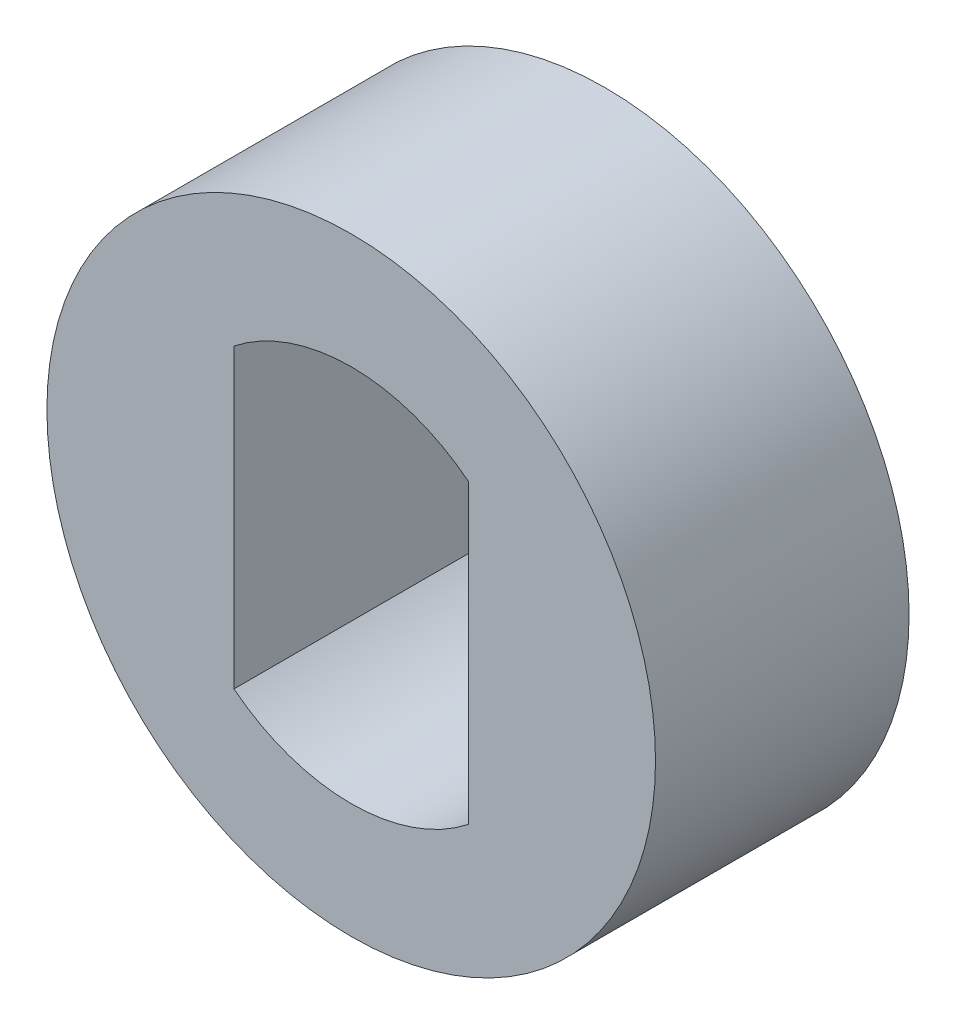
ISO-10303-21;
HEADER;
FILE_DESCRIPTION(('STEP AP214'),'2;1');
FILE_NAME('part.step','',(''),(''),'','','');
FILE_SCHEMA(('AUTOMOTIVE_DESIGN { 1 0 10303 214 1 1 1 1 }'));
ENDSEC;
DATA;
#1=APPLICATION_CONTEXT('core data for automotive mechanical design processes');
#2=APPLICATION_PROTOCOL_DEFINITION('international standard','automotive_design',2000,#1);
#3=PRODUCT_CONTEXT('',#1,'mechanical');
#4=PRODUCT('Part','Part','',(#3));
#5=PRODUCT_RELATED_PRODUCT_CATEGORY('part','',(#4));
#6=PRODUCT_DEFINITION_FORMATION('','',#4);
#7=PRODUCT_DEFINITION_CONTEXT('part definition',#1,'design');
#8=PRODUCT_DEFINITION('design','',#6,#7);
#9=PRODUCT_DEFINITION_SHAPE('','',#8);
#10=(LENGTH_UNIT() NAMED_UNIT(*) SI_UNIT(.MILLI.,.METRE.));
#11=(NAMED_UNIT(*) PLANE_ANGLE_UNIT() SI_UNIT($,.RADIAN.));
#12=(NAMED_UNIT(*) SI_UNIT($,.STERADIAN.) SOLID_ANGLE_UNIT());
#13=UNCERTAINTY_MEASURE_WITH_UNIT(LENGTH_MEASURE(1.E-05),#10,'distance_accuracy_value','');
#14=(GEOMETRIC_REPRESENTATION_CONTEXT(3) GLOBAL_UNCERTAINTY_ASSIGNED_CONTEXT((#13)) GLOBAL_UNIT_ASSIGNED_CONTEXT((#10,
#11,#12)) REPRESENTATION_CONTEXT('',''));
#15=CARTESIAN_POINT('',(0.,0.,0.));
#16=DIRECTION('',(0.,0.,1.));
#17=DIRECTION('',(1.,0.,0.));
#18=AXIS2_PLACEMENT_3D('',#15,#16,#17);
#19=CARTESIAN_POINT('',(0.,0.,4.));
#20=DIRECTION('',(0.,0.,1.));
#21=DIRECTION('',(1.,0.,0.));
#22=AXIS2_PLACEMENT_3D('',#19,#20,#21);
#23=PLANE('',#22);
#24=CARTESIAN_POINT('',(0.,0.,4.));
#25=DIRECTION('',(0.,0.,1.));
#26=DIRECTION('',(1.,0.,0.));
#27=AXIS2_PLACEMENT_3D('',#24,#25,#26);
#28=CIRCLE('',#27,4.8);
#29=CARTESIAN_POINT('',(4.8,0.,4.));
#30=VERTEX_POINT('',#29);
#31=EDGE_CURVE('E11',#30,#30,#28,.T.);
#32=ORIENTED_EDGE('',*,*,#31,.T.);
#33=EDGE_LOOP('',(#32));
#34=FACE_BOUND('',#33,.T.);
#35=DIRECTION('',(0.,-1.,0.));
#36=VECTOR('',#35,1.);
#37=CARTESIAN_POINT('',(-1.85,2.34210949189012,4.));
#38=LINE('',#37,#36);
#39=CARTESIAN_POINT('',(-1.85,2.34210949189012,4.));
#40=VERTEX_POINT('',#39);
#41=CARTESIAN_POINT('',(-1.85,-2.34210949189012,4.));
#42=VERTEX_POINT('',#41);
#43=EDGE_CURVE('E81',#40,#42,#38,.T.);
#44=ORIENTED_EDGE('',*,*,#43,.F.);
#45=CARTESIAN_POINT('',(0.,0.,4.));
#46=DIRECTION('',(0.,0.,1.));
#47=DIRECTION('',(1.,0.,0.));
#48=AXIS2_PLACEMENT_3D('',#45,#46,#47);
#49=CIRCLE('',#48,2.98462340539);
#50=CARTESIAN_POINT('',(1.85,2.34210949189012,4.));
#51=VERTEX_POINT('',#50);
#52=EDGE_CURVE('E73',#51,#40,#49,.T.);
#53=ORIENTED_EDGE('',*,*,#52,.F.);
#54=DIRECTION('',(0.,1.,0.));
#55=VECTOR('',#54,1.);
#56=CARTESIAN_POINT('',(1.85,2.34210949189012,4.));
#57=LINE('',#56,#55);
#58=CARTESIAN_POINT('',(1.85,-2.34210949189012,4.));
#59=VERTEX_POINT('',#58);
#60=EDGE_CURVE('E94',#59,#51,#57,.T.);
#61=ORIENTED_EDGE('',*,*,#60,.F.);
#62=CARTESIAN_POINT('',(0.,0.,4.));
#63=DIRECTION('',(0.,0.,1.));
#64=DIRECTION('',(1.,0.,0.));
#65=AXIS2_PLACEMENT_3D('',#62,#63,#64);
#66=CIRCLE('',#65,2.98462340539);
#67=EDGE_CURVE('E92',#42,#59,#66,.T.);
#68=ORIENTED_EDGE('',*,*,#67,.F.);
#69=EDGE_LOOP('',(#44,#53,#61,#68));
#70=FACE_BOUND('',#69,.T.);
#71=ADVANCED_FACE('F32',(#34,#70),#23,.T.);
#72=CARTESIAN_POINT('',(0.,0.,0.));
#73=DIRECTION('',(0.,0.,1.));
#74=DIRECTION('',(1.,0.,0.));
#75=AXIS2_PLACEMENT_3D('',#72,#73,#74);
#76=PLANE('',#75);
#77=CARTESIAN_POINT('',(0.,0.,0.));
#78=DIRECTION('',(0.,0.,1.));
#79=DIRECTION('',(1.,0.,0.));
#80=AXIS2_PLACEMENT_3D('',#77,#78,#79);
#81=CIRCLE('',#80,4.8);
#82=CARTESIAN_POINT('',(4.8,0.,0.));
#83=VERTEX_POINT('',#82);
#84=EDGE_CURVE('E36',#83,#83,#81,.T.);
#85=ORIENTED_EDGE('',*,*,#84,.F.);
#86=EDGE_LOOP('',(#85));
#87=FACE_BOUND('',#86,.T.);
#88=CARTESIAN_POINT('',(0.,0.,0.));
#89=DIRECTION('',(0.,0.,1.));
#90=DIRECTION('',(1.,0.,0.));
#91=AXIS2_PLACEMENT_3D('',#88,#89,#90);
#92=CIRCLE('',#91,2.98462340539);
#93=CARTESIAN_POINT('',(1.85,2.34210949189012,0.));
#94=VERTEX_POINT('',#93);
#95=CARTESIAN_POINT('',(-1.85,2.34210949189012,0.));
#96=VERTEX_POINT('',#95);
#97=EDGE_CURVE('E55',#94,#96,#92,.T.);
#98=ORIENTED_EDGE('',*,*,#97,.T.);
#99=DIRECTION('',(0.,-1.,0.));
#100=VECTOR('',#99,1.);
#101=CARTESIAN_POINT('',(-1.85,2.34210949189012,0.));
#102=LINE('',#101,#100);
#103=CARTESIAN_POINT('',(-1.85,-2.34210949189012,0.));
#104=VERTEX_POINT('',#103);
#105=EDGE_CURVE('E88',#96,#104,#102,.T.);
#106=ORIENTED_EDGE('',*,*,#105,.T.);
#107=CARTESIAN_POINT('',(0.,0.,0.));
#108=DIRECTION('',(0.,0.,1.));
#109=DIRECTION('',(1.,0.,0.));
#110=AXIS2_PLACEMENT_3D('',#107,#108,#109);
#111=CIRCLE('',#110,2.98462340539);
#112=CARTESIAN_POINT('',(1.85,-2.34210949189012,0.));
#113=VERTEX_POINT('',#112);
#114=EDGE_CURVE('E100',#104,#113,#111,.T.);
#115=ORIENTED_EDGE('',*,*,#114,.T.);
#116=DIRECTION('',(0.,1.,0.));
#117=VECTOR('',#116,1.);
#118=CARTESIAN_POINT('',(1.85,2.34210949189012,0.));
#119=LINE('',#118,#117);
#120=EDGE_CURVE('E82',#113,#94,#119,.T.);
#121=ORIENTED_EDGE('',*,*,#120,.T.);
#122=EDGE_LOOP('',(#98,#106,#115,#121));
#123=FACE_BOUND('',#122,.T.);
#124=ADVANCED_FACE('F111',(#87,#123),#76,.F.);
#125=CARTESIAN_POINT('',(0.,0.,4.));
#126=DIRECTION('',(0.,0.,-1.));
#127=DIRECTION('',(-1.,0.,0.));
#128=AXIS2_PLACEMENT_3D('',#125,#126,#127);
#129=CYLINDRICAL_SURFACE('',#128,4.8);
#130=ORIENTED_EDGE('',*,*,#31,.F.);
#131=EDGE_LOOP('',(#130));
#132=FACE_BOUND('',#131,.T.);
#133=ORIENTED_EDGE('',*,*,#84,.T.);
#134=EDGE_LOOP('',(#133));
#135=FACE_BOUND('',#134,.T.);
#136=ADVANCED_FACE('F34',(#132,#135),#129,.T.);
#137=CARTESIAN_POINT('',(0.,0.,4.));
#138=DIRECTION('',(0.,0.,-1.));
#139=DIRECTION('',(-1.,0.,0.));
#140=AXIS2_PLACEMENT_3D('',#137,#138,#139);
#141=CYLINDRICAL_SURFACE('',#140,2.98462340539);
#142=ORIENTED_EDGE('',*,*,#97,.F.);
#143=DIRECTION('',(0.,0.,-1.));
#144=VECTOR('',#143,1.);
#145=CARTESIAN_POINT('',(1.85,2.34210949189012,4.));
#146=LINE('',#145,#144);
#147=EDGE_CURVE('E77',#51,#94,#146,.T.);
#148=ORIENTED_EDGE('',*,*,#147,.F.);
#149=ORIENTED_EDGE('',*,*,#52,.T.);
#150=DIRECTION('',(0.,0.,-1.));
#151=VECTOR('',#150,1.);
#152=CARTESIAN_POINT('',(-1.85,2.34210949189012,4.));
#153=LINE('',#152,#151);
#154=EDGE_CURVE('E76',#40,#96,#153,.T.);
#155=ORIENTED_EDGE('',*,*,#154,.T.);
#156=EDGE_LOOP('',(#142,#148,#149,#155));
#157=FACE_BOUND('',#156,.T.);
#158=ADVANCED_FACE('F75',(#157),#141,.F.);
#159=CARTESIAN_POINT('',(-1.85,2.34210949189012,4.));
#160=DIRECTION('',(1.,0.,0.));
#161=DIRECTION('',(0.,0.,-1.));
#162=AXIS2_PLACEMENT_3D('',#159,#160,#161);
#163=PLANE('',#162);
#164=ORIENTED_EDGE('',*,*,#105,.F.);
#165=ORIENTED_EDGE('',*,*,#154,.F.);
#166=ORIENTED_EDGE('',*,*,#43,.T.);
#167=DIRECTION('',(0.,0.,-1.));
#168=VECTOR('',#167,1.);
#169=CARTESIAN_POINT('',(-1.85,-2.34210949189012,4.));
#170=LINE('',#169,#168);
#171=EDGE_CURVE('E89',#42,#104,#170,.T.);
#172=ORIENTED_EDGE('',*,*,#171,.T.);
#173=EDGE_LOOP('',(#164,#165,#166,#172));
#174=FACE_BOUND('',#173,.T.);
#175=ADVANCED_FACE('F85',(#174),#163,.T.);
#176=CARTESIAN_POINT('',(0.,0.,4.));
#177=DIRECTION('',(0.,0.,-1.));
#178=DIRECTION('',(-1.,0.,0.));
#179=AXIS2_PLACEMENT_3D('',#176,#177,#178);
#180=CYLINDRICAL_SURFACE('',#179,2.98462340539);
#181=ORIENTED_EDGE('',*,*,#114,.F.);
#182=ORIENTED_EDGE('',*,*,#171,.F.);
#183=ORIENTED_EDGE('',*,*,#67,.T.);
#184=DIRECTION('',(0.,0.,-1.));
#185=VECTOR('',#184,1.);
#186=CARTESIAN_POINT('',(1.85,-2.34210949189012,4.));
#187=LINE('',#186,#185);
#188=EDGE_CURVE('E47',#59,#113,#187,.T.);
#189=ORIENTED_EDGE('',*,*,#188,.T.);
#190=EDGE_LOOP('',(#181,#182,#183,#189));
#191=FACE_BOUND('',#190,.T.);
#192=ADVANCED_FACE('F109',(#191),#180,.F.);
#193=CARTESIAN_POINT('',(1.85,2.34210949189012,4.));
#194=DIRECTION('',(-1.,0.,0.));
#195=DIRECTION('',(0.,0.,1.));
#196=AXIS2_PLACEMENT_3D('',#193,#194,#195);
#197=PLANE('',#196);
#198=ORIENTED_EDGE('',*,*,#120,.F.);
#199=ORIENTED_EDGE('',*,*,#188,.F.);
#200=ORIENTED_EDGE('',*,*,#60,.T.);
#201=ORIENTED_EDGE('',*,*,#147,.T.);
#202=EDGE_LOOP('',(#198,#199,#200,#201));
#203=FACE_BOUND('',#202,.T.);
#204=ADVANCED_FACE('F112',(#203),#197,.T.);
#205=CLOSED_SHELL('',(#71,#124,#136,#158,#175,#192,#204));
#206=MANIFOLD_SOLID_BREP('B2',#205);
#207=ADVANCED_BREP_SHAPE_REPRESENTATION('',(#18,#206),#14);
#208=SHAPE_DEFINITION_REPRESENTATION(#9,#207);
ENDSEC;
END-ISO-10303-21;
